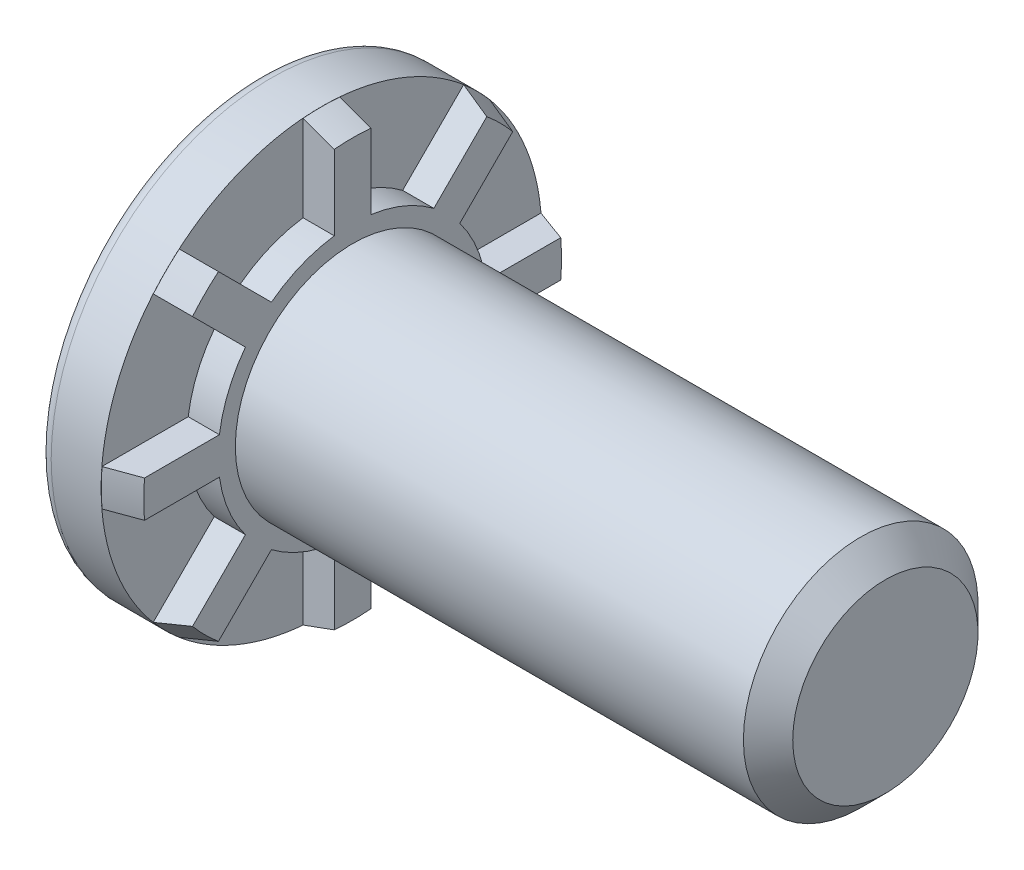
from build123d import *

# Parameters (mm, degrees)
RIBCUT_START     = -1.0541
RIBCUT_DEPTH     = 1.0541
RIBCUTSPAT_COUNT = 8
RIBCUTSPAT_ANGLE = 315


with BuildPart() as part:
    # BodySke → BaseBody (revolve)
    with BuildSketch(Plane.XY, mode=Mode.PRIVATE) as basebody_sk:
        with BuildLine():
            Line((-2.1082, 7.02056), (-2.1082, 0))
            Line((-2.1082, 0), (19.05, 0))
            Line((19.05, 0), (19.05, 3.12928))
            Line((19.05, 3.12928), (18.21688, 3.9624))
            Line((18.21688, 3.9624), (1.0541, 3.9624))
            Line((1.0541, 3.9624), (1.0541, 7.05692346))
            Line((1.0541, 7.05692346), (0.00254, 7.43966))
            Line((0.00254, 7.43966), (0, 7.43966))
            Line((0, 7.43966), (0, 7.4422))
            Line((0, 7.4422), (-1.68656, 7.4422))
            ThreePointArc((-1.68656, 7.4422), (-1.984704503, 7.318704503), (-2.1082, 7.02056))
        make_face()
    revolve(basebody_sk.sketch.rotate(Axis((0, 0, 0), (1, 0, 0)), 90), axis=Axis((0, 0, 0), (1, 0, 0)))

    # RibCutSke → RibCut (cut)
    with BuildSketch(Plane(origin=(1.0541, 1.794401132, -0.090952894), x_dir=(0, 0, -1), z_dir=(1, 0, 0)).offset(RIBCUT_START)):
        with BuildLine():
            Line((0.52890303, 2.705473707), (0.52890303, 5.621940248))
            ThreePointArc((0.52890303, 5.621940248), (2.757053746, 5.081295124), (4.71488806, 3.888048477))
            Line((4.71488806, 3.888048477), (2.652634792, 1.825795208))
            ThreePointArc((2.652634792, 1.825795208), (1.647335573, 2.40219846), (0.52890303, 2.705473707))
        make_face()
    ribcut = extrude(amount=RIBCUT_DEPTH, mode=Mode.SUBTRACT)

    # RibCutsPat: RibCut ×8 about axis
    ribcutspat_axis = Axis((0, 0, 0), (1, 0, 0))
    for i in range(1, RIBCUTSPAT_COUNT):
        add(ribcut.rotate(ribcutspat_axis, i * RIBCUTSPAT_ANGLE / (RIBCUTSPAT_COUNT - 1)), mode=Mode.SUBTRACT)


solid = part.part
